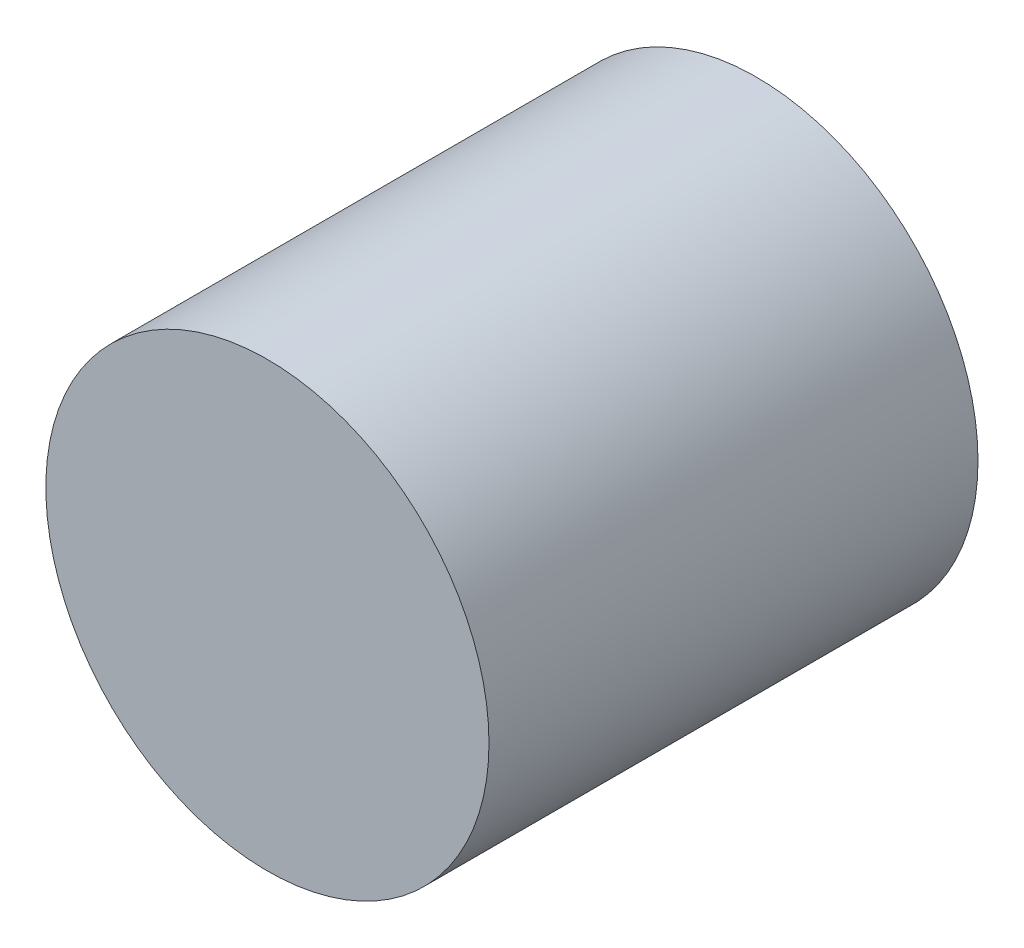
ISO-10303-21;
HEADER;
FILE_DESCRIPTION(('STEP AP214'),'2;1');
FILE_NAME('part.step','',(''),(''),'','','');
FILE_SCHEMA(('AUTOMOTIVE_DESIGN { 1 0 10303 214 1 1 1 1 }'));
ENDSEC;
DATA;
#1=APPLICATION_CONTEXT('core data for automotive mechanical design processes');
#2=APPLICATION_PROTOCOL_DEFINITION('international standard','automotive_design',2000,#1);
#3=PRODUCT_CONTEXT('',#1,'mechanical');
#4=PRODUCT('Part','Part','',(#3));
#5=PRODUCT_RELATED_PRODUCT_CATEGORY('part','',(#4));
#6=PRODUCT_DEFINITION_FORMATION('','',#4);
#7=PRODUCT_DEFINITION_CONTEXT('part definition',#1,'design');
#8=PRODUCT_DEFINITION('design','',#6,#7);
#9=PRODUCT_DEFINITION_SHAPE('','',#8);
#10=(LENGTH_UNIT() NAMED_UNIT(*) SI_UNIT(.MILLI.,.METRE.));
#11=(NAMED_UNIT(*) PLANE_ANGLE_UNIT() SI_UNIT($,.RADIAN.));
#12=(NAMED_UNIT(*) SI_UNIT($,.STERADIAN.) SOLID_ANGLE_UNIT());
#13=UNCERTAINTY_MEASURE_WITH_UNIT(LENGTH_MEASURE(1.E-05),#10,'distance_accuracy_value','');
#14=(GEOMETRIC_REPRESENTATION_CONTEXT(3) GLOBAL_UNCERTAINTY_ASSIGNED_CONTEXT((#13)) GLOBAL_UNIT_ASSIGNED_CONTEXT((#10,
#11,#12)) REPRESENTATION_CONTEXT('',''));
#15=CARTESIAN_POINT('',(0.,0.,0.));
#16=DIRECTION('',(0.,0.,1.));
#17=DIRECTION('',(1.,0.,0.));
#18=AXIS2_PLACEMENT_3D('',#15,#16,#17);
#19=CARTESIAN_POINT('',(0.,0.,32.));
#20=DIRECTION('',(0.,0.,-1.));
#21=DIRECTION('',(-1.,0.,0.));
#22=AXIS2_PLACEMENT_3D('',#19,#20,#21);
#23=CYLINDRICAL_SURFACE('',#22,14.5);
#24=CARTESIAN_POINT('',(0.,0.,32.));
#25=DIRECTION('',(0.,0.,1.));
#26=DIRECTION('',(1.,0.,0.));
#27=AXIS2_PLACEMENT_3D('',#24,#25,#26);
#28=CIRCLE('',#27,14.5);
#29=CARTESIAN_POINT('',(14.5,0.,32.));
#30=VERTEX_POINT('',#29);
#31=EDGE_CURVE('E10',#30,#30,#28,.T.);
#32=ORIENTED_EDGE('',*,*,#31,.F.);
#33=EDGE_LOOP('',(#32));
#34=FACE_BOUND('',#33,.T.);
#35=CARTESIAN_POINT('',(0.,0.,0.));
#36=DIRECTION('',(0.,0.,1.));
#37=DIRECTION('',(1.,0.,0.));
#38=AXIS2_PLACEMENT_3D('',#35,#36,#37);
#39=CIRCLE('',#38,14.5);
#40=CARTESIAN_POINT('',(14.5,0.,0.));
#41=VERTEX_POINT('',#40);
#42=EDGE_CURVE('E33',#41,#41,#39,.T.);
#43=ORIENTED_EDGE('',*,*,#42,.T.);
#44=EDGE_LOOP('',(#43));
#45=FACE_BOUND('',#44,.T.);
#46=ADVANCED_FACE('F30',(#34,#45),#23,.T.);
#47=CARTESIAN_POINT('',(0.,0.,32.));
#48=DIRECTION('',(0.,0.,1.));
#49=DIRECTION('',(1.,0.,0.));
#50=AXIS2_PLACEMENT_3D('',#47,#48,#49);
#51=PLANE('',#50);
#52=ORIENTED_EDGE('',*,*,#31,.T.);
#53=EDGE_LOOP('',(#52));
#54=FACE_BOUND('',#53,.T.);
#55=ADVANCED_FACE('F45',(#54),#51,.T.);
#56=CARTESIAN_POINT('',(0.,0.,0.));
#57=DIRECTION('',(0.,0.,1.));
#58=DIRECTION('',(1.,0.,0.));
#59=AXIS2_PLACEMENT_3D('',#56,#57,#58);
#60=PLANE('',#59);
#61=ORIENTED_EDGE('',*,*,#42,.F.);
#62=EDGE_LOOP('',(#61));
#63=FACE_BOUND('',#62,.T.);
#64=ADVANCED_FACE('F43',(#63),#60,.F.);
#65=CLOSED_SHELL('',(#46,#55,#64));
#66=MANIFOLD_SOLID_BREP('B2',#65);
#67=ADVANCED_BREP_SHAPE_REPRESENTATION('',(#18,#66),#14);
#68=SHAPE_DEFINITION_REPRESENTATION(#9,#67);
ENDSEC;
END-ISO-10303-21;
